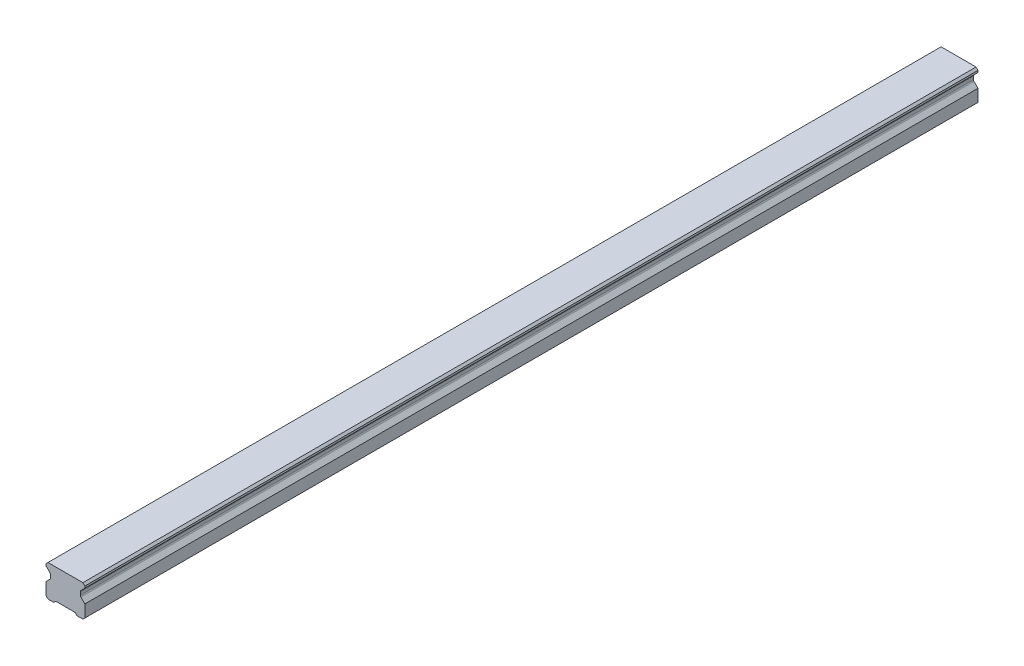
from build123d import *

# Parameters (mm, degrees)
SKETCH1_W           = 20
SKETCH1_H           = 16.3
BOSS_EXTRUDE1_DEPTH = 230
CUT_EXTRUDE1_DEPTH  = 461.397317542
CHAMFER1_SIZE       = 1
FILLET1_R           = 1
CUT_EXTRUDE2_DEPTH  = 461.397317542
SKETCH5_R           = 3
SKETCH5_R_2         = 2.5
CUT_EXTRUDE5_DEPTH  = 10
SKETCH5_2_R         = 2.5
CUT_EXTRUDE6_DEPTH  = 13
LPATTERN2_COUNT     = 8
LPATTERN2_PITCH     = 60


with BuildPart() as part:
    # Sketch1 → Boss-Extrude1 (new, symmetric)
    with BuildSketch(Plane.XY):
        with Locations((0, 8.15)):
            Rectangle(SKETCH1_W, SKETCH1_H)
    extrude(amount=BOSS_EXTRUDE1_DEPTH, both=True)

    # Sketch2 → Cut-Extrude1 (cut, through all)
    with BuildSketch(Plane.XY.offset(230)):
        Polygon((-10, 14.3), (-10, 7.3), (-7.666666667, 9.633333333), (-7.666666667, 11.966666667), align=None)
        Polygon((7.666666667, 11.966666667), (10, 14.3), (10, 7.3), (7.666666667, 9.633333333), align=None)
    extrude(amount=-CUT_EXTRUDE1_DEPTH, mode=Mode.SUBTRACT)

    # Chamfer1
    chamfer1_edges = [part.edges().sort_by_distance(p)[0] for p in [
        (-10, 16.3, 0),
        (10, 16.3, 0),
        (10, 0, 0),
        (-10, 0, 0),
    ]]
    chamfer(chamfer1_edges, length=CHAMFER1_SIZE)

    # Fillet1
    fillet1_edges = [part.edges().sort_by_distance(p)[0] for p in [
        (-7.666666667, 11.966666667, 0),
        (-7.666666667, 9.633333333, 0),
        (7.666666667, 9.633333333, 0),
        (7.666666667, 11.966666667, 0),
    ]]
    fillet(fillet1_edges, radius=FILLET1_R)

    # Sketch3 → Cut-Extrude2 (cut, through all)
    with BuildSketch(Plane.XY.offset(230)):
        Polygon((-6, 0), (-5, 1), (5, 1), (6, 0), align=None)
    extrude(amount=-CUT_EXTRUDE2_DEPTH, mode=Mode.SUBTRACT)

    # Sketch5 → Cut-Extrude5 (cut)
    with BuildSketch(Plane.XZ.offset(-1)):
        with Locations(Location((0, 210, 0), (0, 0, 270))):
            Circle(SKETCH5_R)
        with Locations(Location((0, 210, 0), (0, 0, 270))):
            Circle(SKETCH5_R_2, mode=Mode.SUBTRACT)
    cut_extrude5 = extrude(amount=-CUT_EXTRUDE5_DEPTH, mode=Mode.SUBTRACT)

    # Sketch5_2 → Cut-Extrude6 (cut)
    with BuildSketch(Plane.XZ.offset(-1)):
        with Locations(Location((0, 210, 0), (0, 0, 270))):
            Circle(SKETCH5_2_R)
    cut_extrude6 = extrude(amount=-CUT_EXTRUDE6_DEPTH, mode=Mode.SUBTRACT)

    # Cut-Extrude7 cone 1 section (on through the dimple's axis) → Cut-Extrude7 (revolve, cut)
    with BuildSketch(Plane(origin=(0, 14, 210), x_dir=(0, 0, -1), z_dir=(1, 0, 0))):
        Polygon((0, 0), (2.5, 0), (0, 1.443375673), align=None)
    cut_extrude7 = revolve(axis=Axis((0, 14, 210), (0, 1, 0)), mode=Mode.SUBTRACT)

    # LPattern2: Cut-Extrude5, Cut-Extrude6, Cut-Extrude7 ×8
    with Locations(*[(0, 0, -i * LPATTERN2_PITCH) for i in range(1, LPATTERN2_COUNT)]):
        add(cut_extrude5, mode=Mode.SUBTRACT)
        add(cut_extrude6, mode=Mode.SUBTRACT)
        add(cut_extrude7, mode=Mode.SUBTRACT)


solid = part.part
